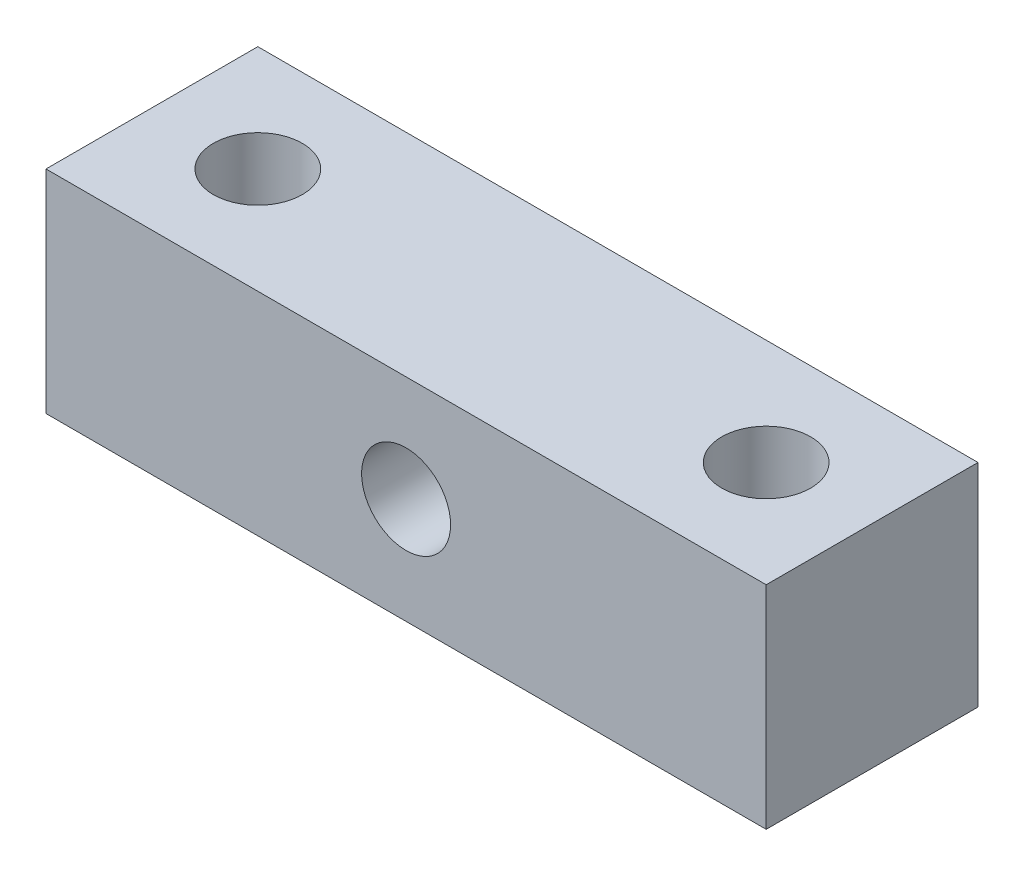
from build123d import *

# Parameters (mm, degrees)
SKETCH1_W                   = 34
SKETCH1_H                   = 10
EXTRUDE1_DEPTH              = 10
M5_TAPPED_HOLE1_D           = 4.2
M5_TAPPED_HOLE1_ON_FACE_2_D = 4.2


with BuildPart() as part:
    # Sketch1 → Extrude1 (new body)
    with BuildSketch(Plane(origin=(0, 0, 0), x_dir=(1, 0, 0), z_dir=(0, 1, 0))):
        with Locations((17, 5)):
            Rectangle(SKETCH1_W, SKETCH1_H)
    extrude(amount=EXTRUDE1_DEPTH)

    # M5 Tapped Hole1 (through all)
    with Locations(Plane(origin=(5, 10, -5), x_dir=(0, 0, 1), z_dir=(0, 1, 0))):
        with Locations((0, 0), (0, 24)):
            Hole(M5_TAPPED_HOLE1_D / 2)

    # M5 Tapped Hole1 on face 2 (through all)
    with Locations(Plane(origin=(17, 5, 0), x_dir=(1, 0, 0), z_dir=(0, 0, 1))):
        with Locations((0, 0)):
            Hole(M5_TAPPED_HOLE1_ON_FACE_2_D / 2)


solid = part.part
